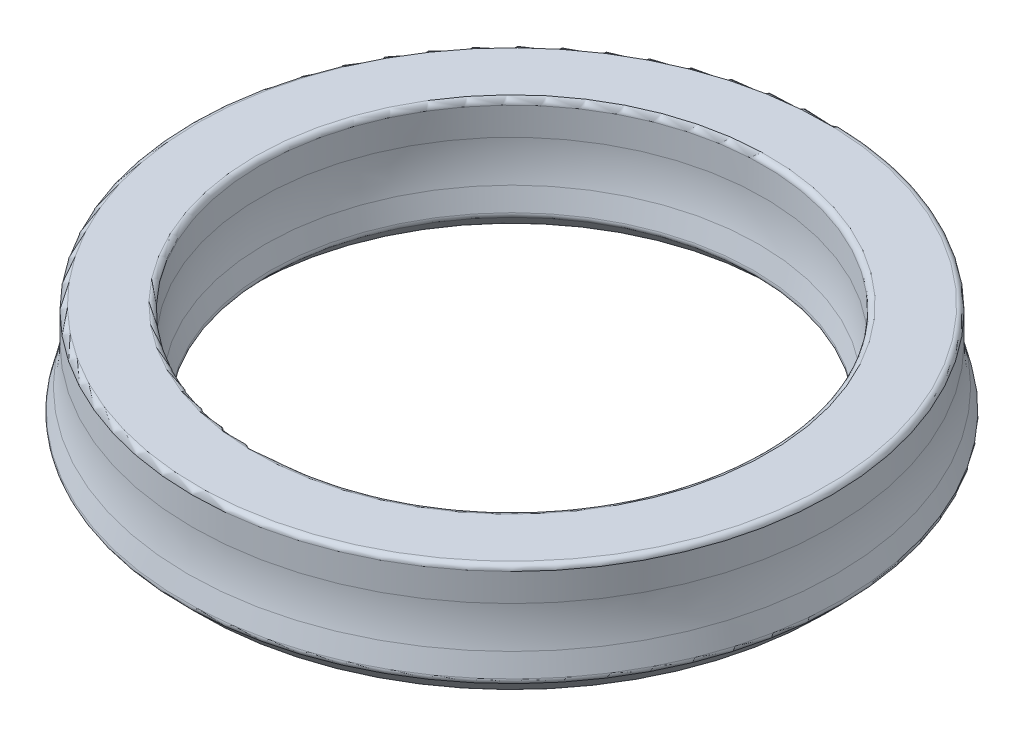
ISO-10303-21;
HEADER;
FILE_DESCRIPTION(('STEP AP214'),'2;1');
FILE_NAME('part.step','',(''),(''),'','','');
FILE_SCHEMA(('AUTOMOTIVE_DESIGN { 1 0 10303 214 1 1 1 1 }'));
ENDSEC;
DATA;
#1=APPLICATION_CONTEXT('core data for automotive mechanical design processes');
#2=APPLICATION_PROTOCOL_DEFINITION('international standard','automotive_design',2000,#1);
#3=PRODUCT_CONTEXT('',#1,'mechanical');
#4=PRODUCT('Part','Part','',(#3));
#5=PRODUCT_RELATED_PRODUCT_CATEGORY('part','',(#4));
#6=PRODUCT_DEFINITION_FORMATION('','',#4);
#7=PRODUCT_DEFINITION_CONTEXT('part definition',#1,'design');
#8=PRODUCT_DEFINITION('design','',#6,#7);
#9=PRODUCT_DEFINITION_SHAPE('','',#8);
#10=(LENGTH_UNIT() NAMED_UNIT(*) SI_UNIT(.MILLI.,.METRE.));
#11=(NAMED_UNIT(*) PLANE_ANGLE_UNIT() SI_UNIT($,.RADIAN.));
#12=(NAMED_UNIT(*) SI_UNIT($,.STERADIAN.) SOLID_ANGLE_UNIT());
#13=UNCERTAINTY_MEASURE_WITH_UNIT(LENGTH_MEASURE(1.E-05),#10,'distance_accuracy_value','');
#14=(GEOMETRIC_REPRESENTATION_CONTEXT(3) GLOBAL_UNCERTAINTY_ASSIGNED_CONTEXT((#13)) GLOBAL_UNIT_ASSIGNED_CONTEXT((#10,
#11,#12)) REPRESENTATION_CONTEXT('',''));
#15=CARTESIAN_POINT('',(0.,0.,0.));
#16=DIRECTION('',(0.,0.,1.));
#17=DIRECTION('',(1.,0.,0.));
#18=AXIS2_PLACEMENT_3D('',#15,#16,#17);
#19=CARTESIAN_POINT('',(6.35,0.,0.));
#20=DIRECTION('',(0.,-1.,0.));
#21=DIRECTION('',(1.,0.,0.));
#22=AXIS2_PLACEMENT_3D('',#19,#20,#21);
#23=PLANE('',#22);
#24=CARTESIAN_POINT('',(0.,0.,0.));
#25=DIRECTION('',(0.,-1.,0.));
#26=DIRECTION('',(1.,0.,0.));
#27=AXIS2_PLACEMENT_3D('',#24,#25,#26);
#28=CIRCLE('',#27,6.40260512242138);
#29=CARTESIAN_POINT('',(6.40260512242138,0.,0.));
#30=VERTEX_POINT('',#29);
#31=EDGE_CURVE('E79',#30,#30,#28,.F.);
#32=ORIENTED_EDGE('',*,*,#31,.T.);
#33=EDGE_LOOP('',(#32));
#34=FACE_BOUND('',#33,.T.);
#35=CARTESIAN_POINT('',(0.,0.,0.));
#36=DIRECTION('',(0.,-1.,0.));
#37=DIRECTION('',(1.,0.,0.));
#38=AXIS2_PLACEMENT_3D('',#35,#36,#37);
#39=CIRCLE('',#38,6.477);
#40=CARTESIAN_POINT('',(6.477,0.,0.));
#41=VERTEX_POINT('',#40);
#42=EDGE_CURVE('E82',#41,#41,#39,.T.);
#43=ORIENTED_EDGE('',*,*,#42,.T.);
#44=EDGE_LOOP('',(#43));
#45=FACE_BOUND('',#44,.T.);
#46=ADVANCED_FACE('F24',(#34,#45),#23,.T.);
#47=CARTESIAN_POINT('',(0.,0.,0.));
#48=DIRECTION('',(0.,-1.,0.));
#49=DIRECTION('',(1.,0.,0.));
#50=AXIS2_PLACEMENT_3D('',#47,#48,#49);
#51=CYLINDRICAL_SURFACE('',#50,6.604);
#52=CARTESIAN_POINT('',(0.,0.126999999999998,0.));
#53=DIRECTION('',(0.,-1.,0.));
#54=DIRECTION('',(1.,0.,0.));
#55=AXIS2_PLACEMENT_3D('',#52,#53,#54);
#56=CIRCLE('',#55,6.604);
#57=CARTESIAN_POINT('',(6.604,0.127,0.));
#58=VERTEX_POINT('',#57);
#59=EDGE_CURVE('E73',#58,#58,#56,.F.);
#60=ORIENTED_EDGE('',*,*,#59,.T.);
#61=EDGE_LOOP('',(#60));
#62=FACE_BOUND('',#61,.T.);
#63=CARTESIAN_POINT('',(0.,2.159,0.));
#64=DIRECTION('',(0.,-1.,0.));
#65=DIRECTION('',(1.,0.,0.));
#66=AXIS2_PLACEMENT_3D('',#63,#64,#65);
#67=CIRCLE('',#66,6.604);
#68=CARTESIAN_POINT('',(6.604,2.159,0.));
#69=VERTEX_POINT('',#68);
#70=EDGE_CURVE('E76',#69,#69,#67,.T.);
#71=ORIENTED_EDGE('',*,*,#70,.T.);
#72=EDGE_LOOP('',(#71));
#73=FACE_BOUND('',#72,.T.);
#74=ADVANCED_FACE('F124',(#62,#73),#51,.T.);
#75=CARTESIAN_POINT('',(6.604,2.286,0.));
#76=DIRECTION('',(0.,-1.,0.));
#77=DIRECTION('',(1.,0.,0.));
#78=AXIS2_PLACEMENT_3D('',#75,#76,#77);
#79=PLANE('',#78);
#80=CARTESIAN_POINT('',(0.,2.286,0.));
#81=DIRECTION('',(0.,-1.,0.));
#82=DIRECTION('',(1.,0.,0.));
#83=AXIS2_PLACEMENT_3D('',#80,#81,#82);
#84=CIRCLE('',#83,6.731);
#85=CARTESIAN_POINT('',(6.731,2.286,0.));
#86=VERTEX_POINT('',#85);
#87=EDGE_CURVE('E49',#86,#86,#84,.F.);
#88=ORIENTED_EDGE('',*,*,#87,.T.);
#89=EDGE_LOOP('',(#88));
#90=FACE_BOUND('',#89,.T.);
#91=CARTESIAN_POINT('',(0.,2.286,0.));
#92=DIRECTION('',(0.,-1.,0.));
#93=DIRECTION('',(1.,0.,0.));
#94=AXIS2_PLACEMENT_3D('',#91,#92,#93);
#95=CIRCLE('',#94,7.112);
#96=CARTESIAN_POINT('',(7.112,2.286,0.));
#97=VERTEX_POINT('',#96);
#98=EDGE_CURVE('E52',#97,#97,#95,.T.);
#99=ORIENTED_EDGE('',*,*,#98,.T.);
#100=EDGE_LOOP('',(#99));
#101=FACE_BOUND('',#100,.T.);
#102=ADVANCED_FACE('F129',(#90,#101),#79,.T.);
#103=CARTESIAN_POINT('',(0.,0.,0.));
#104=DIRECTION('',(0.,-1.,0.));
#105=DIRECTION('',(1.,0.,0.));
#106=AXIS2_PLACEMENT_3D('',#103,#104,#105);
#107=CYLINDRICAL_SURFACE('',#106,7.239);
#108=CARTESIAN_POINT('',(0.,0.126999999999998,0.));
#109=DIRECTION('',(0.,-1.,0.));
#110=DIRECTION('',(1.,0.,0.));
#111=AXIS2_PLACEMENT_3D('',#108,#109,#110);
#112=CIRCLE('',#111,7.239);
#113=CARTESIAN_POINT('',(7.239,0.127,0.));
#114=VERTEX_POINT('',#113);
#115=EDGE_CURVE('E67',#114,#114,#112,.T.);
#116=ORIENTED_EDGE('',*,*,#115,.T.);
#117=EDGE_LOOP('',(#116));
#118=FACE_BOUND('',#117,.T.);
#119=CARTESIAN_POINT('',(0.,2.159,0.));
#120=DIRECTION('',(0.,-1.,0.));
#121=DIRECTION('',(1.,0.,0.));
#122=AXIS2_PLACEMENT_3D('',#119,#120,#121);
#123=CIRCLE('',#122,7.239);
#124=CARTESIAN_POINT('',(7.239,2.159,0.));
#125=VERTEX_POINT('',#124);
#126=EDGE_CURVE('E70',#125,#125,#123,.F.);
#127=ORIENTED_EDGE('',*,*,#126,.T.);
#128=EDGE_LOOP('',(#127));
#129=FACE_BOUND('',#128,.T.);
#130=ADVANCED_FACE('F194',(#118,#129),#107,.F.);
#131=CARTESIAN_POINT('',(7.493,0.,0.));
#132=DIRECTION('',(0.,-1.,0.));
#133=DIRECTION('',(1.,0.,0.));
#134=AXIS2_PLACEMENT_3D('',#131,#132,#133);
#135=PLANE('',#134);
#136=CARTESIAN_POINT('',(0.,0.,0.));
#137=DIRECTION('',(0.,-1.,0.));
#138=DIRECTION('',(1.,0.,0.));
#139=AXIS2_PLACEMENT_3D('',#136,#137,#138);
#140=CIRCLE('',#139,7.366);
#141=CARTESIAN_POINT('',(7.366,0.,0.));
#142=VERTEX_POINT('',#141);
#143=EDGE_CURVE('E61',#142,#142,#140,.F.);
#144=ORIENTED_EDGE('',*,*,#143,.T.);
#145=EDGE_LOOP('',(#144));
#146=FACE_BOUND('',#145,.T.);
#147=CARTESIAN_POINT('',(0.,0.,0.));
#148=DIRECTION('',(0.,-1.,0.));
#149=DIRECTION('',(1.,0.,0.));
#150=AXIS2_PLACEMENT_3D('',#147,#148,#149);
#151=CIRCLE('',#150,7.44039487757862);
#152=CARTESIAN_POINT('',(7.44039487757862,0.,0.));
#153=VERTEX_POINT('',#152);
#154=EDGE_CURVE('E64',#153,#153,#151,.T.);
#155=ORIENTED_EDGE('',*,*,#154,.T.);
#156=EDGE_LOOP('',(#155));
#157=FACE_BOUND('',#156,.T.);
#158=ADVANCED_FACE('F185',(#146,#157),#135,.T.);
#159=CARTESIAN_POINT('',(0.,0.,0.));
#160=DIRECTION('',(0.,1.,0.));
#161=DIRECTION('',(-1.,0.,0.));
#162=AXIS2_PLACEMENT_3D('',#159,#160,#161);
#163=CONICAL_SURFACE('',#162,7.493,0.785398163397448);
#164=CARTESIAN_POINT('',(0.,0.0371974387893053,0.));
#165=DIRECTION('',(0.,-1.,0.));
#166=DIRECTION('',(1.,0.,0.));
#167=AXIS2_PLACEMENT_3D('',#164,#165,#166);
#168=CIRCLE('',#167,7.53019743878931);
#169=CARTESIAN_POINT('',(7.53019743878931,0.0371974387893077,0.));
#170=VERTEX_POINT('',#169);
#171=EDGE_CURVE('E55',#170,#170,#168,.F.);
#172=ORIENTED_EDGE('',*,*,#171,.T.);
#173=EDGE_LOOP('',(#172));
#174=FACE_BOUND('',#173,.T.);
#175=CARTESIAN_POINT('',(0.,0.457154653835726,0.));
#176=DIRECTION('',(0.,-1.,0.));
#177=DIRECTION('',(1.,0.,0.));
#178=AXIS2_PLACEMENT_3D('',#175,#176,#177);
#179=CIRCLE('',#178,7.95015465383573);
#180=CARTESIAN_POINT('',(7.95015465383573,0.457154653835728,0.));
#181=VERTEX_POINT('',#180);
#182=EDGE_CURVE('E58',#181,#181,#179,.T.);
#183=ORIENTED_EDGE('',*,*,#182,.T.);
#184=EDGE_LOOP('',(#183));
#185=FACE_BOUND('',#184,.T.);
#186=ADVANCED_FACE('F182',(#174,#185),#163,.T.);
#187=CARTESIAN_POINT('',(0.,0.507999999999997,0.));
#188=DIRECTION('',(0.,-1.,0.));
#189=DIRECTION('',(1.,0.,0.));
#190=AXIS2_PLACEMENT_3D('',#187,#188,#189);
#191=CONICAL_SURFACE('',#190,8.001,0.244978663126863);
#192=CARTESIAN_POINT('',(0.,0.577759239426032,0.));
#193=DIRECTION('',(0.,1.,0.));
#194=DIRECTION('',(-1.,0.,0.));
#195=AXIS2_PLACEMENT_3D('',#192,#193,#194);
#196=CIRCLE('',#195,7.98356019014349);
#197=CARTESIAN_POINT('',(-7.98356019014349,0.577759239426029,0.));
#198=VERTEX_POINT('',#197);
#199=EDGE_CURVE('E10',#198,#198,#196,.T.);
#200=ORIENTED_EDGE('',*,*,#199,.T.);
#201=EDGE_LOOP('',(#200));
#202=FACE_BOUND('',#201,.T.);
#203=CARTESIAN_POINT('',(0.,1.06897170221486,0.));
#204=DIRECTION('',(0.,-1.,0.));
#205=DIRECTION('',(1.,0.,0.));
#206=AXIS2_PLACEMENT_3D('',#203,#204,#205);
#207=CIRCLE('',#206,7.86075707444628);
#208=CARTESIAN_POINT('',(7.86075707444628,1.06897170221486,0.));
#209=VERTEX_POINT('',#208);
#210=EDGE_CURVE('E94',#209,#209,#207,.T.);
#211=ORIENTED_EDGE('',*,*,#210,.T.);
#212=EDGE_LOOP('',(#211));
#213=FACE_BOUND('',#212,.T.);
#214=ADVANCED_FACE('F184',(#202,#213),#191,.T.);
#215=CARTESIAN_POINT('',(0.,0.,0.));
#216=DIRECTION('',(0.,-1.,0.));
#217=DIRECTION('',(1.,0.,0.));
#218=AXIS2_PLACEMENT_3D('',#215,#216,#217);
#219=CYLINDRICAL_SURFACE('',#218,7.747);
#220=CARTESIAN_POINT('',(0.,2.667,0.));
#221=DIRECTION('',(0.,1.,0.));
#222=DIRECTION('',(-1.,0.,0.));
#223=AXIS2_PLACEMENT_3D('',#220,#221,#222);
#224=CIRCLE('',#223,7.747);
#225=CARTESIAN_POINT('',(-7.747,2.66699999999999,0.));
#226=VERTEX_POINT('',#225);
#227=EDGE_CURVE('E46',#226,#226,#224,.F.);
#228=ORIENTED_EDGE('',*,*,#227,.T.);
#229=EDGE_LOOP('',(#228));
#230=FACE_BOUND('',#229,.T.);
#231=CARTESIAN_POINT('',(0.,1.99303243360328,0.));
#232=DIRECTION('',(0.,-1.,0.));
#233=DIRECTION('',(1.,0.,0.));
#234=AXIS2_PLACEMENT_3D('',#231,#232,#233);
#235=CIRCLE('',#234,7.747);
#236=CARTESIAN_POINT('',(7.747,1.99303243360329,0.));
#237=VERTEX_POINT('',#236);
#238=EDGE_CURVE('E91',#237,#237,#235,.F.);
#239=ORIENTED_EDGE('',*,*,#238,.T.);
#240=EDGE_LOOP('',(#239));
#241=FACE_BOUND('',#240,.T.);
#242=ADVANCED_FACE('F192',(#230,#241),#219,.T.);
#243=CARTESIAN_POINT('',(6.096,2.794,0.));
#244=DIRECTION('',(0.,1.,0.));
#245=DIRECTION('',(-1.,0.,0.));
#246=AXIS2_PLACEMENT_3D('',#243,#244,#245);
#247=PLANE('',#246);
#248=CARTESIAN_POINT('',(0.,2.794,0.));
#249=DIRECTION('',(0.,1.,0.));
#250=DIRECTION('',(-1.,0.,0.));
#251=AXIS2_PLACEMENT_3D('',#248,#249,#250);
#252=CIRCLE('',#251,7.62);
#253=CARTESIAN_POINT('',(-7.62,2.794,0.));
#254=VERTEX_POINT('',#253);
#255=EDGE_CURVE('E38',#254,#254,#252,.T.);
#256=ORIENTED_EDGE('',*,*,#255,.T.);
#257=EDGE_LOOP('',(#256));
#258=FACE_BOUND('',#257,.T.);
#259=CARTESIAN_POINT('',(0.,2.794,0.));
#260=DIRECTION('',(0.,1.,0.));
#261=DIRECTION('',(-1.,0.,0.));
#262=AXIS2_PLACEMENT_3D('',#259,#260,#261);
#263=CIRCLE('',#262,6.223);
#264=CARTESIAN_POINT('',(-6.223,2.794,0.));
#265=VERTEX_POINT('',#264);
#266=EDGE_CURVE('E43',#265,#265,#263,.F.);
#267=ORIENTED_EDGE('',*,*,#266,.T.);
#268=EDGE_LOOP('',(#267));
#269=FACE_BOUND('',#268,.T.);
#270=ADVANCED_FACE('F236',(#258,#269),#247,.T.);
#271=CARTESIAN_POINT('',(0.,0.,0.));
#272=DIRECTION('',(0.,-1.,0.));
#273=DIRECTION('',(1.,0.,0.));
#274=AXIS2_PLACEMENT_3D('',#271,#272,#273);
#275=CYLINDRICAL_SURFACE('',#274,6.096);
#276=CARTESIAN_POINT('',(0.,2.667,0.));
#277=DIRECTION('',(0.,1.,0.));
#278=DIRECTION('',(-1.,0.,0.));
#279=AXIS2_PLACEMENT_3D('',#276,#277,#278);
#280=CIRCLE('',#279,6.096);
#281=CARTESIAN_POINT('',(-6.096,2.667,0.));
#282=VERTEX_POINT('',#281);
#283=EDGE_CURVE('E34',#282,#282,#280,.T.);
#284=ORIENTED_EDGE('',*,*,#283,.T.);
#285=EDGE_LOOP('',(#284));
#286=FACE_BOUND('',#285,.T.);
#287=CARTESIAN_POINT('',(0.,1.99303243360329,0.));
#288=DIRECTION('',(0.,-1.,0.));
#289=DIRECTION('',(1.,0.,0.));
#290=AXIS2_PLACEMENT_3D('',#287,#288,#289);
#291=CIRCLE('',#290,6.096);
#292=CARTESIAN_POINT('',(6.096,1.99303243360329,0.));
#293=VERTEX_POINT('',#292);
#294=EDGE_CURVE('E100',#293,#293,#291,.T.);
#295=ORIENTED_EDGE('',*,*,#294,.T.);
#296=EDGE_LOOP('',(#295));
#297=FACE_BOUND('',#296,.T.);
#298=ADVANCED_FACE('F104',(#286,#297),#275,.F.);
#299=CARTESIAN_POINT('',(0.,1.524,0.));
#300=DIRECTION('',(0.,1.,0.));
#301=DIRECTION('',(-1.,0.,0.));
#302=AXIS2_PLACEMENT_3D('',#299,#300,#301);
#303=CONICAL_SURFACE('',#302,6.096,0.244978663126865);
#304=CARTESIAN_POINT('',(0.,0.577759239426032,0.));
#305=DIRECTION('',(0.,-1.,0.));
#306=DIRECTION('',(1.,0.,0.));
#307=AXIS2_PLACEMENT_3D('',#304,#305,#306);
#308=CIRCLE('',#307,5.85943980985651);
#309=CARTESIAN_POINT('',(5.85943980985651,0.577759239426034,0.));
#310=VERTEX_POINT('',#309);
#311=EDGE_CURVE('E30',#310,#310,#308,.T.);
#312=ORIENTED_EDGE('',*,*,#311,.T.);
#313=EDGE_LOOP('',(#312));
#314=FACE_BOUND('',#313,.T.);
#315=CARTESIAN_POINT('',(0.,1.06897170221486,0.));
#316=DIRECTION('',(0.,1.,0.));
#317=DIRECTION('',(-1.,0.,0.));
#318=AXIS2_PLACEMENT_3D('',#315,#316,#317);
#319=CIRCLE('',#318,5.98224292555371);
#320=CARTESIAN_POINT('',(-5.98224292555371,1.06897170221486,0.));
#321=VERTEX_POINT('',#320);
#322=EDGE_CURVE('E97',#321,#321,#319,.T.);
#323=ORIENTED_EDGE('',*,*,#322,.T.);
#324=EDGE_LOOP('',(#323));
#325=FACE_BOUND('',#324,.T.);
#326=ADVANCED_FACE('F119',(#314,#325),#303,.F.);
#327=CARTESIAN_POINT('',(0.,0.507999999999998,0.));
#328=DIRECTION('',(0.,-1.,0.));
#329=DIRECTION('',(1.,0.,0.));
#330=AXIS2_PLACEMENT_3D('',#327,#328,#329);
#331=CONICAL_SURFACE('',#330,5.842,0.785398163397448);
#332=CARTESIAN_POINT('',(0.,0.0371974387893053,0.));
#333=DIRECTION('',(0.,1.,0.));
#334=DIRECTION('',(-1.,0.,0.));
#335=AXIS2_PLACEMENT_3D('',#332,#333,#334);
#336=CIRCLE('',#335,6.31280256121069);
#337=CARTESIAN_POINT('',(-6.31280256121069,0.0371974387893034,0.));
#338=VERTEX_POINT('',#337);
#339=EDGE_CURVE('E85',#338,#338,#336,.F.);
#340=ORIENTED_EDGE('',*,*,#339,.T.);
#341=EDGE_LOOP('',(#340));
#342=FACE_BOUND('',#341,.T.);
#343=CARTESIAN_POINT('',(0.,0.457154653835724,0.));
#344=DIRECTION('',(0.,1.,0.));
#345=DIRECTION('',(-1.,0.,0.));
#346=AXIS2_PLACEMENT_3D('',#343,#344,#345);
#347=CIRCLE('',#346,5.89284534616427);
#348=CARTESIAN_POINT('',(-5.89284534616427,0.457154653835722,0.));
#349=VERTEX_POINT('',#348);
#350=EDGE_CURVE('E88',#349,#349,#347,.T.);
#351=ORIENTED_EDGE('',*,*,#350,.T.);
#352=EDGE_LOOP('',(#351));
#353=FACE_BOUND('',#352,.T.);
#354=ADVANCED_FACE('F109',(#342,#353),#331,.F.);
#355=CARTESIAN_POINT('',(0.,1.99303243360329,0.));
#356=DIRECTION('',(0.,-1.,0.));
#357=DIRECTION('',(1.,0.,0.));
#358=AXIS2_PLACEMENT_3D('',#355,#356,#357);
#359=DEGENERATE_TOROIDAL_SURFACE('',#358,2.286,3.81,.T.);
#360=ORIENTED_EDGE('',*,*,#322,.F.);
#361=EDGE_LOOP('',(#360));
#362=FACE_BOUND('',#361,.T.);
#363=ORIENTED_EDGE('',*,*,#294,.F.);
#364=EDGE_LOOP('',(#363));
#365=FACE_BOUND('',#364,.T.);
#366=ADVANCED_FACE('F106',(#362,#365),#359,.F.);
#367=CARTESIAN_POINT('',(0.,1.99303243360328,0.));
#368=DIRECTION('',(0.,-1.,0.));
#369=DIRECTION('',(1.,0.,0.));
#370=AXIS2_PLACEMENT_3D('',#367,#368,#369);
#371=TOROIDAL_SURFACE('',#370,11.557,3.81);
#372=ORIENTED_EDGE('',*,*,#238,.F.);
#373=EDGE_LOOP('',(#372));
#374=FACE_BOUND('',#373,.T.);
#375=ORIENTED_EDGE('',*,*,#210,.F.);
#376=EDGE_LOOP('',(#375));
#377=FACE_BOUND('',#376,.T.);
#378=ADVANCED_FACE('F108',(#374,#377),#371,.F.);
#379=CARTESIAN_POINT('',(0.,0.126999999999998,0.));
#380=DIRECTION('',(0.,-1.,0.));
#381=DIRECTION('',(1.,0.,0.));
#382=AXIS2_PLACEMENT_3D('',#379,#380,#381);
#383=TOROIDAL_SURFACE('',#382,6.40260512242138,0.127);
#384=ORIENTED_EDGE('',*,*,#31,.F.);
#385=EDGE_LOOP('',(#384));
#386=FACE_BOUND('',#385,.T.);
#387=ORIENTED_EDGE('',*,*,#339,.F.);
#388=EDGE_LOOP('',(#387));
#389=FACE_BOUND('',#388,.T.);
#390=ADVANCED_FACE('F115',(#386,#389),#383,.T.);
#391=CARTESIAN_POINT('',(0.,0.126999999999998,0.));
#392=DIRECTION('',(0.,-1.,0.));
#393=DIRECTION('',(1.,0.,0.));
#394=AXIS2_PLACEMENT_3D('',#391,#392,#393);
#395=TOROIDAL_SURFACE('',#394,6.477,0.127);
#396=ORIENTED_EDGE('',*,*,#59,.F.);
#397=EDGE_LOOP('',(#396));
#398=FACE_BOUND('',#397,.T.);
#399=ORIENTED_EDGE('',*,*,#42,.F.);
#400=EDGE_LOOP('',(#399));
#401=FACE_BOUND('',#400,.T.);
#402=ADVANCED_FACE('F135',(#398,#401),#395,.T.);
#403=CARTESIAN_POINT('',(0.,0.126999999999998,0.));
#404=DIRECTION('',(0.,-1.,0.));
#405=DIRECTION('',(1.,0.,0.));
#406=AXIS2_PLACEMENT_3D('',#403,#404,#405);
#407=TOROIDAL_SURFACE('',#406,7.366,0.127);
#408=ORIENTED_EDGE('',*,*,#143,.F.);
#409=EDGE_LOOP('',(#408));
#410=FACE_BOUND('',#409,.T.);
#411=ORIENTED_EDGE('',*,*,#115,.F.);
#412=EDGE_LOOP('',(#411));
#413=FACE_BOUND('',#412,.T.);
#414=ADVANCED_FACE('F137',(#410,#413),#407,.T.);
#415=CARTESIAN_POINT('',(0.,0.126999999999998,0.));
#416=DIRECTION('',(0.,-1.,0.));
#417=DIRECTION('',(1.,0.,0.));
#418=AXIS2_PLACEMENT_3D('',#415,#416,#417);
#419=TOROIDAL_SURFACE('',#418,7.44039487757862,0.127);
#420=ORIENTED_EDGE('',*,*,#171,.F.);
#421=EDGE_LOOP('',(#420));
#422=FACE_BOUND('',#421,.T.);
#423=ORIENTED_EDGE('',*,*,#154,.F.);
#424=EDGE_LOOP('',(#423));
#425=FACE_BOUND('',#424,.T.);
#426=ADVANCED_FACE('F144',(#422,#425),#419,.T.);
#427=CARTESIAN_POINT('',(0.,2.159,0.));
#428=DIRECTION('',(0.,-1.,0.));
#429=DIRECTION('',(1.,0.,0.));
#430=AXIS2_PLACEMENT_3D('',#427,#428,#429);
#431=TOROIDAL_SURFACE('',#430,6.731,0.127);
#432=ORIENTED_EDGE('',*,*,#87,.F.);
#433=EDGE_LOOP('',(#432));
#434=FACE_BOUND('',#433,.T.);
#435=ORIENTED_EDGE('',*,*,#70,.F.);
#436=EDGE_LOOP('',(#435));
#437=FACE_BOUND('',#436,.T.);
#438=ADVANCED_FACE('F153',(#434,#437),#431,.F.);
#439=CARTESIAN_POINT('',(0.,2.159,0.));
#440=DIRECTION('',(0.,-1.,0.));
#441=DIRECTION('',(1.,0.,0.));
#442=AXIS2_PLACEMENT_3D('',#439,#440,#441);
#443=TOROIDAL_SURFACE('',#442,7.112,0.127);
#444=ORIENTED_EDGE('',*,*,#126,.F.);
#445=EDGE_LOOP('',(#444));
#446=FACE_BOUND('',#445,.T.);
#447=ORIENTED_EDGE('',*,*,#98,.F.);
#448=EDGE_LOOP('',(#447));
#449=FACE_BOUND('',#448,.T.);
#450=ADVANCED_FACE('F157',(#446,#449),#443,.F.);
#451=CARTESIAN_POINT('',(0.,2.667,0.));
#452=DIRECTION('',(0.,1.,0.));
#453=DIRECTION('',(-1.,0.,0.));
#454=AXIS2_PLACEMENT_3D('',#451,#452,#453);
#455=TOROIDAL_SURFACE('',#454,7.62,0.127);
#456=ORIENTED_EDGE('',*,*,#255,.F.);
#457=EDGE_LOOP('',(#456));
#458=FACE_BOUND('',#457,.T.);
#459=ORIENTED_EDGE('',*,*,#227,.F.);
#460=EDGE_LOOP('',(#459));
#461=FACE_BOUND('',#460,.T.);
#462=ADVANCED_FACE('F161',(#458,#461),#455,.T.);
#463=CARTESIAN_POINT('',(0.,2.667,0.));
#464=DIRECTION('',(0.,1.,0.));
#465=DIRECTION('',(-1.,0.,0.));
#466=AXIS2_PLACEMENT_3D('',#463,#464,#465);
#467=TOROIDAL_SURFACE('',#466,6.223,0.127);
#468=ORIENTED_EDGE('',*,*,#283,.F.);
#469=EDGE_LOOP('',(#468));
#470=FACE_BOUND('',#469,.T.);
#471=ORIENTED_EDGE('',*,*,#266,.F.);
#472=EDGE_LOOP('',(#471));
#473=FACE_BOUND('',#472,.T.);
#474=ADVANCED_FACE('F165',(#470,#473),#467,.T.);
#475=CARTESIAN_POINT('',(0.,0.546957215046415,0.));
#476=DIRECTION('',(0.,1.,0.));
#477=DIRECTION('',(-1.,0.,0.));
#478=AXIS2_PLACEMENT_3D('',#475,#476,#477);
#479=TOROIDAL_SURFACE('',#478,5.98264790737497,0.127);
#480=ORIENTED_EDGE('',*,*,#350,.F.);
#481=EDGE_LOOP('',(#480));
#482=FACE_BOUND('',#481,.T.);
#483=ORIENTED_EDGE('',*,*,#311,.F.);
#484=EDGE_LOOP('',(#483));
#485=FACE_BOUND('',#484,.T.);
#486=ADVANCED_FACE('F169',(#482,#485),#479,.T.);
#487=CARTESIAN_POINT('',(0.,0.546957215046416,0.));
#488=DIRECTION('',(0.,1.,0.));
#489=DIRECTION('',(-1.,0.,0.));
#490=AXIS2_PLACEMENT_3D('',#487,#488,#489);
#491=TOROIDAL_SURFACE('',#490,7.86035209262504,0.127);
#492=ORIENTED_EDGE('',*,*,#199,.F.);
#493=EDGE_LOOP('',(#492));
#494=FACE_BOUND('',#493,.T.);
#495=ORIENTED_EDGE('',*,*,#182,.F.);
#496=EDGE_LOOP('',(#495));
#497=FACE_BOUND('',#496,.T.);
#498=ADVANCED_FACE('F173',(#494,#497),#491,.T.);
#499=CLOSED_SHELL('',(#46,#74,#102,#130,#158,#186,#214,#242,#270,#298,#326,#354,#366,#378,#390,
#402,#414,#426,#438,#450,#462,#474,#486,#498));
#500=MANIFOLD_SOLID_BREP('B2',#499);
#501=ADVANCED_BREP_SHAPE_REPRESENTATION('',(#18,#500),#14);
#502=SHAPE_DEFINITION_REPRESENTATION(#9,#501);
ENDSEC;
END-ISO-10303-21;
